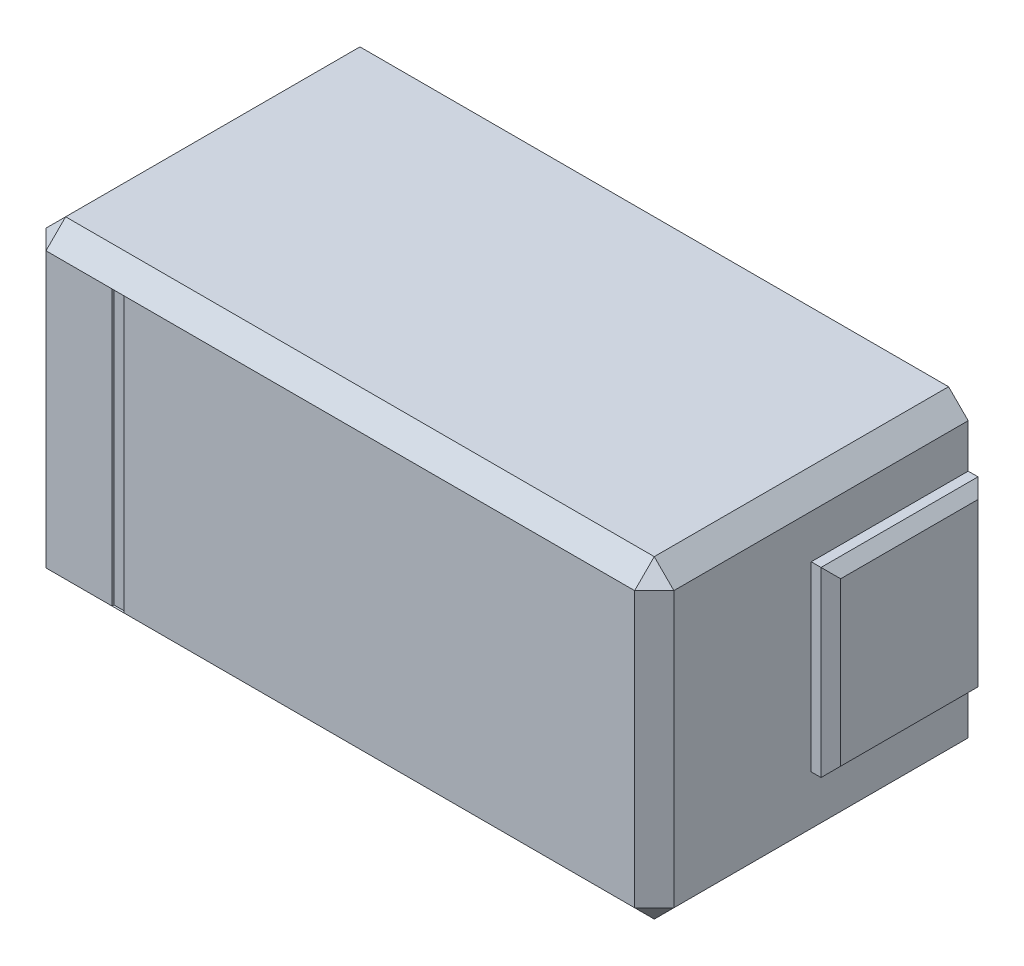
ISO-10303-21;
HEADER;
FILE_DESCRIPTION(('STEP AP214'),'2;1');
FILE_NAME('part.step','',(''),(''),'','','');
FILE_SCHEMA(('AUTOMOTIVE_DESIGN { 1 0 10303 214 1 1 1 1 }'));
ENDSEC;
DATA;
#1=APPLICATION_CONTEXT('core data for automotive mechanical design processes');
#2=APPLICATION_PROTOCOL_DEFINITION('international standard','automotive_design',2000,#1);
#3=PRODUCT_CONTEXT('',#1,'mechanical');
#4=PRODUCT('Part','Part','',(#3));
#5=PRODUCT_RELATED_PRODUCT_CATEGORY('part','',(#4));
#6=PRODUCT_DEFINITION_FORMATION('','',#4);
#7=PRODUCT_DEFINITION_CONTEXT('part definition',#1,'design');
#8=PRODUCT_DEFINITION('design','',#6,#7);
#9=PRODUCT_DEFINITION_SHAPE('','',#8);
#10=(LENGTH_UNIT() NAMED_UNIT(*) SI_UNIT(.MILLI.,.METRE.));
#11=(NAMED_UNIT(*) PLANE_ANGLE_UNIT() SI_UNIT($,.RADIAN.));
#12=(NAMED_UNIT(*) SI_UNIT($,.STERADIAN.) SOLID_ANGLE_UNIT());
#13=UNCERTAINTY_MEASURE_WITH_UNIT(LENGTH_MEASURE(1.E-05),#10,'distance_accuracy_value','');
#14=(GEOMETRIC_REPRESENTATION_CONTEXT(3) GLOBAL_UNCERTAINTY_ASSIGNED_CONTEXT((#13)) GLOBAL_UNIT_ASSIGNED_CONTEXT((#10,
#11,#12)) REPRESENTATION_CONTEXT('',''));
#15=CARTESIAN_POINT('',(0.,0.,0.));
#16=DIRECTION('',(0.,0.,1.));
#17=DIRECTION('',(1.,0.,0.));
#18=AXIS2_PLACEMENT_3D('',#15,#16,#17);
#19=CARTESIAN_POINT('',(0.,0.,1.6));
#20=DIRECTION('',(0.,0.,-1.));
#21=DIRECTION('',(-1.,0.,0.));
#22=AXIS2_PLACEMENT_3D('',#19,#20,#21);
#23=PLANE('',#22);
#24=DIRECTION('',(1.,0.,0.));
#25=VECTOR('',#24,1.);
#26=CARTESIAN_POINT('',(0.,0.0999999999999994,1.6));
#27=LINE('',#26,#25);
#28=CARTESIAN_POINT('',(0.100000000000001,0.0999999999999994,1.6));
#29=VERTEX_POINT('',#28);
#30=CARTESIAN_POINT('',(0.436338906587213,0.100000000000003,1.6));
#31=VERTEX_POINT('',#30);
#32=EDGE_CURVE('E230',#29,#31,#27,.T.);
#33=ORIENTED_EDGE('',*,*,#32,.T.);
#34=DIRECTION('',(0.,-1.,0.));
#35=VECTOR('',#34,1.);
#36=CARTESIAN_POINT('',(0.436338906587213,0.100000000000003,1.6));
#37=LINE('',#36,#35);
#38=CARTESIAN_POINT('',(0.436338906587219,1.50000000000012,1.6));
#39=VERTEX_POINT('',#38);
#40=EDGE_CURVE('E217',#39,#31,#37,.T.);
#41=ORIENTED_EDGE('',*,*,#40,.F.);
#42=DIRECTION('',(-1.,0.,0.));
#43=VECTOR('',#42,1.);
#44=CARTESIAN_POINT('',(0.,1.50000000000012,1.6));
#45=LINE('',#44,#43);
#46=CARTESIAN_POINT('',(0.100000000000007,1.50000000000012,1.6));
#47=VERTEX_POINT('',#46);
#48=EDGE_CURVE('E239',#39,#47,#45,.T.);
#49=ORIENTED_EDGE('',*,*,#48,.T.);
#50=DIRECTION('',(0.,-1.,0.));
#51=VECTOR('',#50,1.);
#52=CARTESIAN_POINT('',(0.100000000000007,0.,1.6));
#53=LINE('',#52,#51);
#54=EDGE_CURVE('E236',#47,#29,#53,.T.);
#55=ORIENTED_EDGE('',*,*,#54,.T.);
#56=EDGE_LOOP('',(#33,#41,#49,#55));
#57=FACE_BOUND('',#56,.T.);
#58=ADVANCED_FACE('F31',(#57),#23,.F.);
#59=CARTESIAN_POINT('',(3.20000000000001,1.60000000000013,1.6));
#60=DIRECTION('',(1.,0.,0.));
#61=DIRECTION('',(0.,0.,-1.));
#62=AXIS2_PLACEMENT_3D('',#59,#60,#61);
#63=PLANE('',#62);
#64=DIRECTION('',(0.,-1.,0.));
#65=VECTOR('',#64,1.);
#66=CARTESIAN_POINT('',(3.2,0.,1.5));
#67=LINE('',#66,#65);
#68=CARTESIAN_POINT('',(3.2,1.50000000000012,1.5));
#69=VERTEX_POINT('',#68);
#70=CARTESIAN_POINT('',(3.2,0.100000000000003,1.5));
#71=VERTEX_POINT('',#70);
#72=EDGE_CURVE('E256',#69,#71,#67,.T.);
#73=ORIENTED_EDGE('',*,*,#72,.T.);
#74=DIRECTION('',(0.,0.,-1.));
#75=VECTOR('',#74,1.);
#76=CARTESIAN_POINT('',(3.2,0.100000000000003,0.));
#77=LINE('',#76,#75);
#78=CARTESIAN_POINT('',(3.2,0.100000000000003,0.));
#79=VERTEX_POINT('',#78);
#80=EDGE_CURVE('E258',#71,#79,#77,.T.);
#81=ORIENTED_EDGE('',*,*,#80,.T.);
#82=DIRECTION('',(0.,-1.,0.));
#83=VECTOR('',#82,1.);
#84=CARTESIAN_POINT('',(3.20000000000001,1.60000000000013,0.));
#85=LINE('',#84,#83);
#86=CARTESIAN_POINT('',(3.2,0.350000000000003,0.));
#87=VERTEX_POINT('',#86);
#88=EDGE_CURVE('E447',#87,#79,#85,.T.);
#89=ORIENTED_EDGE('',*,*,#88,.F.);
#90=DIRECTION('',(0.,0.,-1.));
#91=VECTOR('',#90,1.);
#92=CARTESIAN_POINT('',(3.2,0.350000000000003,0.));
#93=LINE('',#92,#91);
#94=CARTESIAN_POINT('',(3.2,0.350000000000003,0.800000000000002));
#95=VERTEX_POINT('',#94);
#96=EDGE_CURVE('E337',#95,#87,#93,.T.);
#97=ORIENTED_EDGE('',*,*,#96,.F.);
#98=DIRECTION('',(0.,-1.,0.));
#99=VECTOR('',#98,1.);
#100=CARTESIAN_POINT('',(3.2,1.27731712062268,0.800000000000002));
#101=LINE('',#100,#99);
#102=CARTESIAN_POINT('',(3.2,1.27731712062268,0.800000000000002));
#103=VERTEX_POINT('',#102);
#104=EDGE_CURVE('E332',#103,#95,#101,.T.);
#105=ORIENTED_EDGE('',*,*,#104,.F.);
#106=DIRECTION('',(0.,0.,1.));
#107=VECTOR('',#106,1.);
#108=CARTESIAN_POINT('',(3.2,1.27731712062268,0.));
#109=LINE('',#108,#107);
#110=CARTESIAN_POINT('',(3.2,1.27731712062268,0.));
#111=VERTEX_POINT('',#110);
#112=EDGE_CURVE('E441',#111,#103,#109,.T.);
#113=ORIENTED_EDGE('',*,*,#112,.F.);
#114=CARTESIAN_POINT('',(3.2,1.50000000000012,0.));
#115=VERTEX_POINT('',#114);
#116=EDGE_CURVE('E451',#115,#111,#85,.T.);
#117=ORIENTED_EDGE('',*,*,#116,.F.);
#118=DIRECTION('',(0.,0.,1.));
#119=VECTOR('',#118,1.);
#120=CARTESIAN_POINT('',(3.2,1.50000000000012,1.6));
#121=LINE('',#120,#119);
#122=EDGE_CURVE('E254',#115,#69,#121,.T.);
#123=ORIENTED_EDGE('',*,*,#122,.T.);
#124=EDGE_LOOP('',(#73,#81,#89,#97,#105,#113,#117,#123));
#125=FACE_BOUND('',#124,.T.);
#126=ADVANCED_FACE('F448',(#125),#63,.T.);
#127=CARTESIAN_POINT('',(0.,0.,1.6));
#128=DIRECTION('',(-1.,0.,0.));
#129=DIRECTION('',(0.,0.,1.));
#130=AXIS2_PLACEMENT_3D('',#127,#128,#129);
#131=PLANE('',#130);
#132=DIRECTION('',(0.,1.,0.));
#133=VECTOR('',#132,1.);
#134=CARTESIAN_POINT('',(0.,1.60000000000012,1.5));
#135=LINE('',#134,#133);
#136=CARTESIAN_POINT('',(0.,0.100000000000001,1.5));
#137=VERTEX_POINT('',#136);
#138=CARTESIAN_POINT('',(0.,1.50000000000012,1.5));
#139=VERTEX_POINT('',#138);
#140=EDGE_CURVE('E381',#137,#139,#135,.T.);
#141=ORIENTED_EDGE('',*,*,#140,.T.);
#142=DIRECTION('',(0.,0.,-1.));
#143=VECTOR('',#142,1.);
#144=CARTESIAN_POINT('',(0.,1.50000000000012,0.));
#145=LINE('',#144,#143);
#146=CARTESIAN_POINT('',(0.,1.50000000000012,0.));
#147=VERTEX_POINT('',#146);
#148=EDGE_CURVE('E380',#139,#147,#145,.T.);
#149=ORIENTED_EDGE('',*,*,#148,.T.);
#150=DIRECTION('',(0.,1.,0.));
#151=VECTOR('',#150,1.);
#152=CARTESIAN_POINT('',(0.,0.,0.));
#153=LINE('',#152,#151);
#154=CARTESIAN_POINT('',(0.,1.3,0.));
#155=VERTEX_POINT('',#154);
#156=EDGE_CURVE('E272',#155,#147,#153,.T.);
#157=ORIENTED_EDGE('',*,*,#156,.F.);
#158=DIRECTION('',(0.,0.,-1.));
#159=VECTOR('',#158,1.);
#160=CARTESIAN_POINT('',(0.,1.3,0.));
#161=LINE('',#160,#159);
#162=CARTESIAN_POINT('',(0.,1.3,0.750000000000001));
#163=VERTEX_POINT('',#162);
#164=EDGE_CURVE('E296',#163,#155,#161,.T.);
#165=ORIENTED_EDGE('',*,*,#164,.F.);
#166=DIRECTION('',(0.,1.,0.));
#167=VECTOR('',#166,1.);
#168=CARTESIAN_POINT('',(0.,1.3,0.750000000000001));
#169=LINE('',#168,#167);
#170=CARTESIAN_POINT('',(0.,0.3,0.750000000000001));
#171=VERTEX_POINT('',#170);
#172=EDGE_CURVE('E290',#171,#163,#169,.T.);
#173=ORIENTED_EDGE('',*,*,#172,.F.);
#174=DIRECTION('',(0.,0.,1.));
#175=VECTOR('',#174,1.);
#176=CARTESIAN_POINT('',(0.,0.3,0.));
#177=LINE('',#176,#175);
#178=CARTESIAN_POINT('',(0.,0.3,0.));
#179=VERTEX_POINT('',#178);
#180=EDGE_CURVE('E287',#179,#171,#177,.T.);
#181=ORIENTED_EDGE('',*,*,#180,.F.);
#182=CARTESIAN_POINT('',(0.,0.100000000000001,0.));
#183=VERTEX_POINT('',#182);
#184=EDGE_CURVE('E267',#183,#179,#153,.T.);
#185=ORIENTED_EDGE('',*,*,#184,.F.);
#186=DIRECTION('',(0.,0.,1.));
#187=VECTOR('',#186,1.);
#188=CARTESIAN_POINT('',(0.,0.100000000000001,1.6));
#189=LINE('',#188,#187);
#190=EDGE_CURVE('E266',#183,#137,#189,.T.);
#191=ORIENTED_EDGE('',*,*,#190,.T.);
#192=EDGE_LOOP('',(#141,#149,#157,#165,#173,#181,#185,#191));
#193=FACE_BOUND('',#192,.T.);
#194=ADVANCED_FACE('F33',(#193),#131,.T.);
#195=CARTESIAN_POINT('',(0.,0.,1.6));
#196=DIRECTION('',(0.,1.,0.));
#197=DIRECTION('',(0.,0.,1.));
#198=AXIS2_PLACEMENT_3D('',#195,#196,#197);
#199=PLANE('',#198);
#200=DIRECTION('',(-1.,0.,0.));
#201=VECTOR('',#200,1.);
#202=CARTESIAN_POINT('',(0.,0.,1.5));
#203=LINE('',#202,#201);
#204=CARTESIAN_POINT('',(3.1,0.,1.5));
#205=VERTEX_POINT('',#204);
#206=CARTESIAN_POINT('',(0.100000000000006,0.,1.5));
#207=VERTEX_POINT('',#206);
#208=EDGE_CURVE('E262',#205,#207,#203,.T.);
#209=ORIENTED_EDGE('',*,*,#208,.T.);
#210=DIRECTION('',(0.,0.,-1.));
#211=VECTOR('',#210,1.);
#212=CARTESIAN_POINT('',(0.0999999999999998,0.,0.));
#213=LINE('',#212,#211);
#214=CARTESIAN_POINT('',(0.0999999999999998,0.,0.));
#215=VERTEX_POINT('',#214);
#216=EDGE_CURVE('E264',#207,#215,#213,.T.);
#217=ORIENTED_EDGE('',*,*,#216,.T.);
#218=DIRECTION('',(1.,0.,0.));
#219=VECTOR('',#218,1.);
#220=CARTESIAN_POINT('',(0.,0.,0.));
#221=LINE('',#220,#219);
#222=CARTESIAN_POINT('',(3.1,0.,0.));
#223=VERTEX_POINT('',#222);
#224=EDGE_CURVE('E286',#215,#223,#221,.T.);
#225=ORIENTED_EDGE('',*,*,#224,.T.);
#226=DIRECTION('',(0.,0.,1.));
#227=VECTOR('',#226,1.);
#228=CARTESIAN_POINT('',(3.1,0.,1.6));
#229=LINE('',#228,#227);
#230=EDGE_CURVE('E260',#223,#205,#229,.T.);
#231=ORIENTED_EDGE('',*,*,#230,.T.);
#232=EDGE_LOOP('',(#209,#217,#225,#231));
#233=FACE_BOUND('',#232,.T.);
#234=ADVANCED_FACE('F554',(#233),#199,.F.);
#235=CARTESIAN_POINT('',(3.20000000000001,1.60000000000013,1.6));
#236=DIRECTION('',(0.,-1.,0.));
#237=DIRECTION('',(1.,0.,0.));
#238=AXIS2_PLACEMENT_3D('',#235,#236,#237);
#239=PLANE('',#238);
#240=DIRECTION('',(-1.,0.,0.));
#241=VECTOR('',#240,1.);
#242=CARTESIAN_POINT('',(3.20000000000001,1.60000000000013,0.));
#243=LINE('',#242,#241);
#244=CARTESIAN_POINT('',(3.10000000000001,1.60000000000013,0.));
#245=VERTEX_POINT('',#244);
#246=CARTESIAN_POINT('',(0.100000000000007,1.60000000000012,0.));
#247=VERTEX_POINT('',#246);
#248=EDGE_CURVE('E271',#245,#247,#243,.T.);
#249=ORIENTED_EDGE('',*,*,#248,.T.);
#250=DIRECTION('',(0.,0.,1.));
#251=VECTOR('',#250,1.);
#252=CARTESIAN_POINT('',(0.100000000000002,1.60000000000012,1.6));
#253=LINE('',#252,#251);
#254=CARTESIAN_POINT('',(0.100000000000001,1.60000000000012,1.5));
#255=VERTEX_POINT('',#254);
#256=EDGE_CURVE('E252',#247,#255,#253,.T.);
#257=ORIENTED_EDGE('',*,*,#256,.T.);
#258=DIRECTION('',(1.,0.,0.));
#259=VECTOR('',#258,1.);
#260=CARTESIAN_POINT('',(3.20000000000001,1.60000000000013,1.5));
#261=LINE('',#260,#259);
#262=CARTESIAN_POINT('',(3.10000000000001,1.60000000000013,1.5));
#263=VERTEX_POINT('',#262);
#264=EDGE_CURVE('E249',#255,#263,#261,.T.);
#265=ORIENTED_EDGE('',*,*,#264,.T.);
#266=DIRECTION('',(0.,0.,-1.));
#267=VECTOR('',#266,1.);
#268=CARTESIAN_POINT('',(3.10000000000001,1.60000000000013,0.));
#269=LINE('',#268,#267);
#270=EDGE_CURVE('E247',#263,#245,#269,.T.);
#271=ORIENTED_EDGE('',*,*,#270,.T.);
#272=EDGE_LOOP('',(#249,#257,#265,#271));
#273=FACE_BOUND('',#272,.T.);
#274=ADVANCED_FACE('F456',(#273),#239,.F.);
#275=CARTESIAN_POINT('',(3.1,1.50000000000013,1.6));
#276=VERTEX_POINT('',#275);
#277=CARTESIAN_POINT('',(0.498779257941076,1.50000000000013,1.6));
#278=VERTEX_POINT('',#277);
#279=EDGE_CURVE('E244',#276,#278,#45,.T.);
#280=ORIENTED_EDGE('',*,*,#279,.T.);
#281=DIRECTION('',(0.,1.,0.));
#282=VECTOR('',#281,1.);
#283=CARTESIAN_POINT('',(0.49877925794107,0.100000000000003,1.6));
#284=LINE('',#283,#282);
#285=CARTESIAN_POINT('',(0.49877925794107,0.100000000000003,1.6));
#286=VERTEX_POINT('',#285);
#287=EDGE_CURVE('E46',#286,#278,#284,.T.);
#288=ORIENTED_EDGE('',*,*,#287,.F.);
#289=CARTESIAN_POINT('',(3.1,0.100000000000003,1.6));
#290=VERTEX_POINT('',#289);
#291=EDGE_CURVE('E233',#286,#290,#27,.T.);
#292=ORIENTED_EDGE('',*,*,#291,.T.);
#293=DIRECTION('',(0.,1.,0.));
#294=VECTOR('',#293,1.);
#295=CARTESIAN_POINT('',(3.10000000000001,1.60000000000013,1.6));
#296=LINE('',#295,#294);
#297=EDGE_CURVE('E237',#290,#276,#296,.T.);
#298=ORIENTED_EDGE('',*,*,#297,.T.);
#299=EDGE_LOOP('',(#280,#288,#292,#298));
#300=FACE_BOUND('',#299,.T.);
#301=ADVANCED_FACE('F541',(#300),#23,.F.);
#302=CARTESIAN_POINT('',(0.,0.,0.));
#303=DIRECTION('',(0.,0.,-1.));
#304=DIRECTION('',(-1.,0.,0.));
#305=AXIS2_PLACEMENT_3D('',#302,#303,#304);
#306=PLANE('',#305);
#307=DIRECTION('',(1.,0.,0.));
#308=VECTOR('',#307,1.);
#309=CARTESIAN_POINT('',(-0.1,0.3,0.));
#310=LINE('',#309,#308);
#311=CARTESIAN_POINT('',(-0.0499999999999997,0.3,0.));
#312=VERTEX_POINT('',#311);
#313=EDGE_CURVE('E285',#312,#179,#310,.T.);
#314=ORIENTED_EDGE('',*,*,#313,.F.);
#315=DIRECTION('',(0.,1.,0.));
#316=VECTOR('',#315,1.);
#317=CARTESIAN_POINT('',(-0.0499999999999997,0.,0.));
#318=LINE('',#317,#316);
#319=CARTESIAN_POINT('',(-0.0499999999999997,1.3,0.));
#320=VERTEX_POINT('',#319);
#321=EDGE_CURVE('E307',#312,#320,#318,.T.);
#322=ORIENTED_EDGE('',*,*,#321,.T.);
#323=DIRECTION('',(1.,0.,0.));
#324=VECTOR('',#323,1.);
#325=CARTESIAN_POINT('',(-0.1,1.3,0.));
#326=LINE('',#325,#324);
#327=EDGE_CURVE('E345',#320,#155,#326,.T.);
#328=ORIENTED_EDGE('',*,*,#327,.T.);
#329=ORIENTED_EDGE('',*,*,#156,.T.);
#330=DIRECTION('',(0.707106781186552,0.707106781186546,0.));
#331=VECTOR('',#330,1.);
#332=CARTESIAN_POINT('',(-0.750000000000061,0.750000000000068,0.));
#333=LINE('',#332,#331);
#334=EDGE_CURVE('E372',#147,#247,#333,.T.);
#335=ORIENTED_EDGE('',*,*,#334,.T.);
#336=ORIENTED_EDGE('',*,*,#248,.F.);
#337=DIRECTION('',(0.707106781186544,-0.707106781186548,0.));
#338=VECTOR('',#337,1.);
#339=CARTESIAN_POINT('',(2.35000000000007,2.35000000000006,0.));
#340=LINE('',#339,#338);
#341=EDGE_CURVE('E378',#245,#115,#340,.T.);
#342=ORIENTED_EDGE('',*,*,#341,.T.);
#343=ORIENTED_EDGE('',*,*,#116,.T.);
#344=DIRECTION('',(-1.,0.,0.));
#345=VECTOR('',#344,1.);
#346=CARTESIAN_POINT('',(3.3,1.27731712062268,0.));
#347=LINE('',#346,#345);
#348=CARTESIAN_POINT('',(3.25,1.27731712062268,0.));
#349=VERTEX_POINT('',#348);
#350=EDGE_CURVE('E291',#349,#111,#347,.T.);
#351=ORIENTED_EDGE('',*,*,#350,.F.);
#352=DIRECTION('',(0.,-1.,0.));
#353=VECTOR('',#352,1.);
#354=CARTESIAN_POINT('',(3.25,0.350000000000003,0.));
#355=LINE('',#354,#353);
#356=CARTESIAN_POINT('',(3.25,0.350000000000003,0.));
#357=VERTEX_POINT('',#356);
#358=EDGE_CURVE('E305',#349,#357,#355,.T.);
#359=ORIENTED_EDGE('',*,*,#358,.T.);
#360=DIRECTION('',(-1.,0.,0.));
#361=VECTOR('',#360,1.);
#362=CARTESIAN_POINT('',(3.3,0.35,0.));
#363=LINE('',#362,#361);
#364=EDGE_CURVE('E327',#357,#87,#363,.T.);
#365=ORIENTED_EDGE('',*,*,#364,.T.);
#366=ORIENTED_EDGE('',*,*,#88,.T.);
#367=DIRECTION('',(-0.707106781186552,-0.707106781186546,0.));
#368=VECTOR('',#367,1.);
#369=CARTESIAN_POINT('',(1.54999999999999,-1.55000000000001,0.));
#370=LINE('',#369,#368);
#371=EDGE_CURVE('E376',#79,#223,#370,.T.);
#372=ORIENTED_EDGE('',*,*,#371,.T.);
#373=ORIENTED_EDGE('',*,*,#224,.F.);
#374=DIRECTION('',(-0.707106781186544,0.707106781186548,0.));
#375=VECTOR('',#374,1.);
#376=CARTESIAN_POINT('',(0.050000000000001,0.0499999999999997,0.));
#377=LINE('',#376,#375);
#378=EDGE_CURVE('E374',#215,#183,#377,.T.);
#379=ORIENTED_EDGE('',*,*,#378,.T.);
#380=ORIENTED_EDGE('',*,*,#184,.T.);
#381=EDGE_LOOP('',(#314,#322,#328,#329,#335,#336,#342,#343,#351,#359,#365,#366,#372,#373,#379,#380));
#382=FACE_BOUND('',#381,.T.);
#383=ADVANCED_FACE('F462',(#382),#306,.T.);
#384=CARTESIAN_POINT('',(-0.1,0.3,0.));
#385=DIRECTION('',(0.,1.,0.));
#386=DIRECTION('',(0.,0.,1.));
#387=AXIS2_PLACEMENT_3D('',#384,#385,#386);
#388=PLANE('',#387);
#389=DIRECTION('',(1.,0.,0.));
#390=VECTOR('',#389,1.);
#391=CARTESIAN_POINT('',(-0.1,0.3,0.750000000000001));
#392=LINE('',#391,#390);
#393=CARTESIAN_POINT('',(-0.0499999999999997,0.3,0.750000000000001));
#394=VERTEX_POINT('',#393);
#395=EDGE_CURVE('E277',#394,#171,#392,.T.);
#396=ORIENTED_EDGE('',*,*,#395,.F.);
#397=DIRECTION('',(0.,0.,-1.));
#398=VECTOR('',#397,1.);
#399=CARTESIAN_POINT('',(-0.0499999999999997,0.3,0.));
#400=LINE('',#399,#398);
#401=EDGE_CURVE('E303',#394,#312,#400,.T.);
#402=ORIENTED_EDGE('',*,*,#401,.T.);
#403=ORIENTED_EDGE('',*,*,#313,.T.);
#404=ORIENTED_EDGE('',*,*,#180,.T.);
#405=EDGE_LOOP('',(#396,#402,#403,#404));
#406=FACE_BOUND('',#405,.T.);
#407=ADVANCED_FACE('F560',(#406),#388,.F.);
#408=CARTESIAN_POINT('',(-0.1,1.3,0.750000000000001));
#409=DIRECTION('',(0.,0.,-1.));
#410=DIRECTION('',(-1.,0.,0.));
#411=AXIS2_PLACEMENT_3D('',#408,#409,#410);
#412=PLANE('',#411);
#413=DIRECTION('',(1.,0.,0.));
#414=VECTOR('',#413,1.);
#415=CARTESIAN_POINT('',(-0.1,1.3,0.750000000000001));
#416=LINE('',#415,#414);
#417=CARTESIAN_POINT('',(-0.0499999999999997,1.3,0.750000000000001));
#418=VERTEX_POINT('',#417);
#419=EDGE_CURVE('E344',#418,#163,#416,.T.);
#420=ORIENTED_EDGE('',*,*,#419,.F.);
#421=DIRECTION('',(0.,-1.,0.));
#422=VECTOR('',#421,1.);
#423=CARTESIAN_POINT('',(-0.0499999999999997,0.3,0.750000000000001));
#424=LINE('',#423,#422);
#425=EDGE_CURVE('E301',#418,#394,#424,.T.);
#426=ORIENTED_EDGE('',*,*,#425,.T.);
#427=ORIENTED_EDGE('',*,*,#395,.T.);
#428=ORIENTED_EDGE('',*,*,#172,.T.);
#429=EDGE_LOOP('',(#420,#426,#427,#428));
#430=FACE_BOUND('',#429,.T.);
#431=ADVANCED_FACE('F569',(#430),#412,.F.);
#432=CARTESIAN_POINT('',(-0.1,1.3,0.));
#433=DIRECTION('',(0.,-1.,0.));
#434=DIRECTION('',(0.,0.,-1.));
#435=AXIS2_PLACEMENT_3D('',#432,#433,#434);
#436=PLANE('',#435);
#437=ORIENTED_EDGE('',*,*,#327,.F.);
#438=DIRECTION('',(0.,0.,1.));
#439=VECTOR('',#438,1.);
#440=CARTESIAN_POINT('',(-0.0499999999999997,1.3,0.750000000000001));
#441=LINE('',#440,#439);
#442=EDGE_CURVE('E358',#320,#418,#441,.T.);
#443=ORIENTED_EDGE('',*,*,#442,.T.);
#444=ORIENTED_EDGE('',*,*,#419,.T.);
#445=ORIENTED_EDGE('',*,*,#164,.T.);
#446=EDGE_LOOP('',(#437,#443,#444,#445));
#447=FACE_BOUND('',#446,.T.);
#448=ADVANCED_FACE('F464',(#447),#436,.F.);
#449=CARTESIAN_POINT('',(-0.1,0.3,0.));
#450=DIRECTION('',(-1.,0.,0.));
#451=DIRECTION('',(0.,0.,1.));
#452=AXIS2_PLACEMENT_3D('',#449,#450,#451);
#453=PLANE('',#452);
#454=DIRECTION('',(0.,1.,0.));
#455=VECTOR('',#454,1.);
#456=CARTESIAN_POINT('',(-0.1,1.3,0.699999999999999));
#457=LINE('',#456,#455);
#458=CARTESIAN_POINT('',(-0.0999999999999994,0.35,0.699999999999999));
#459=VERTEX_POINT('',#458);
#460=CARTESIAN_POINT('',(-0.0999999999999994,1.25,0.699999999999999));
#461=VERTEX_POINT('',#460);
#462=EDGE_CURVE('E362',#459,#461,#457,.T.);
#463=ORIENTED_EDGE('',*,*,#462,.T.);
#464=DIRECTION('',(0.,0.,-1.));
#465=VECTOR('',#464,1.);
#466=CARTESIAN_POINT('',(-0.0999999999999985,1.25,0.));
#467=LINE('',#466,#465);
#468=CARTESIAN_POINT('',(-0.0999999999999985,1.25,0.0500000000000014));
#469=VERTEX_POINT('',#468);
#470=EDGE_CURVE('E356',#461,#469,#467,.T.);
#471=ORIENTED_EDGE('',*,*,#470,.T.);
#472=DIRECTION('',(0.,-1.,0.));
#473=VECTOR('',#472,1.);
#474=CARTESIAN_POINT('',(-0.1,0.3,0.0500000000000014));
#475=LINE('',#474,#473);
#476=CARTESIAN_POINT('',(-0.0999999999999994,0.35,0.0500000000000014));
#477=VERTEX_POINT('',#476);
#478=EDGE_CURVE('E368',#469,#477,#475,.T.);
#479=ORIENTED_EDGE('',*,*,#478,.T.);
#480=DIRECTION('',(0.,0.,1.));
#481=VECTOR('',#480,1.);
#482=CARTESIAN_POINT('',(-0.0999999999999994,0.35,0.750000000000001));
#483=LINE('',#482,#481);
#484=EDGE_CURVE('E365',#477,#459,#483,.T.);
#485=ORIENTED_EDGE('',*,*,#484,.T.);
#486=EDGE_LOOP('',(#463,#471,#479,#485));
#487=FACE_BOUND('',#486,.T.);
#488=ADVANCED_FACE('F576',(#487),#453,.T.);
#489=CARTESIAN_POINT('',(3.3,1.27731712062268,0.));
#490=DIRECTION('',(0.,-1.,0.));
#491=DIRECTION('',(0.,0.,-1.));
#492=AXIS2_PLACEMENT_3D('',#489,#490,#491);
#493=PLANE('',#492);
#494=DIRECTION('',(-1.,0.,0.));
#495=VECTOR('',#494,1.);
#496=CARTESIAN_POINT('',(3.3,1.27731712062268,0.800000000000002));
#497=LINE('',#496,#495);
#498=CARTESIAN_POINT('',(3.25,1.27731712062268,0.800000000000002));
#499=VERTEX_POINT('',#498);
#500=EDGE_CURVE('E334',#499,#103,#497,.T.);
#501=ORIENTED_EDGE('',*,*,#500,.F.);
#502=DIRECTION('',(0.,0.,-1.));
#503=VECTOR('',#502,1.);
#504=CARTESIAN_POINT('',(3.25,1.27731712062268,0.));
#505=LINE('',#504,#503);
#506=EDGE_CURVE('E11',#499,#349,#505,.T.);
#507=ORIENTED_EDGE('',*,*,#506,.T.);
#508=ORIENTED_EDGE('',*,*,#350,.T.);
#509=ORIENTED_EDGE('',*,*,#112,.T.);
#510=EDGE_LOOP('',(#501,#507,#508,#509));
#511=FACE_BOUND('',#510,.T.);
#512=ADVANCED_FACE('F505',(#511),#493,.F.);
#513=CARTESIAN_POINT('',(3.3,1.27731712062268,0.800000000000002));
#514=DIRECTION('',(0.,0.,-1.));
#515=DIRECTION('',(-1.,0.,0.));
#516=AXIS2_PLACEMENT_3D('',#513,#514,#515);
#517=PLANE('',#516);
#518=DIRECTION('',(-1.,0.,0.));
#519=VECTOR('',#518,1.);
#520=CARTESIAN_POINT('',(3.3,0.35,0.800000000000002));
#521=LINE('',#520,#519);
#522=CARTESIAN_POINT('',(3.25,0.350000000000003,0.800000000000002));
#523=VERTEX_POINT('',#522);
#524=EDGE_CURVE('E325',#523,#95,#521,.T.);
#525=ORIENTED_EDGE('',*,*,#524,.F.);
#526=DIRECTION('',(0.,1.,0.));
#527=VECTOR('',#526,1.);
#528=CARTESIAN_POINT('',(3.25,1.27731712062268,0.800000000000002));
#529=LINE('',#528,#527);
#530=EDGE_CURVE('E39',#523,#499,#529,.T.);
#531=ORIENTED_EDGE('',*,*,#530,.T.);
#532=ORIENTED_EDGE('',*,*,#500,.T.);
#533=ORIENTED_EDGE('',*,*,#104,.T.);
#534=EDGE_LOOP('',(#525,#531,#532,#533));
#535=FACE_BOUND('',#534,.T.);
#536=ADVANCED_FACE('F330',(#535),#517,.F.);
#537=CARTESIAN_POINT('',(3.3,0.35,0.));
#538=DIRECTION('',(0.,1.,0.));
#539=DIRECTION('',(0.,0.,1.));
#540=AXIS2_PLACEMENT_3D('',#537,#538,#539);
#541=PLANE('',#540);
#542=ORIENTED_EDGE('',*,*,#364,.F.);
#543=DIRECTION('',(0.,0.,1.));
#544=VECTOR('',#543,1.);
#545=CARTESIAN_POINT('',(3.25,0.350000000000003,0.));
#546=LINE('',#545,#544);
#547=EDGE_CURVE('E318',#357,#523,#546,.T.);
#548=ORIENTED_EDGE('',*,*,#547,.T.);
#549=ORIENTED_EDGE('',*,*,#524,.T.);
#550=ORIENTED_EDGE('',*,*,#96,.T.);
#551=EDGE_LOOP('',(#542,#548,#549,#550));
#552=FACE_BOUND('',#551,.T.);
#553=ADVANCED_FACE('F323',(#552),#541,.F.);
#554=CARTESIAN_POINT('',(3.3,0.35,0.));
#555=DIRECTION('',(-1.,0.,0.));
#556=DIRECTION('',(0.,0.,1.));
#557=AXIS2_PLACEMENT_3D('',#554,#555,#556);
#558=PLANE('',#557);
#559=DIRECTION('',(0.,-1.,0.));
#560=VECTOR('',#559,1.);
#561=CARTESIAN_POINT('',(3.3,0.35,0.750000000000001));
#562=LINE('',#561,#560);
#563=CARTESIAN_POINT('',(3.30000000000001,1.22731712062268,0.750000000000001));
#564=VERTEX_POINT('',#563);
#565=CARTESIAN_POINT('',(3.30000000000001,0.399999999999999,0.750000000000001));
#566=VERTEX_POINT('',#565);
#567=EDGE_CURVE('E313',#564,#566,#562,.T.);
#568=ORIENTED_EDGE('',*,*,#567,.T.);
#569=DIRECTION('',(0.,0.,-1.));
#570=VECTOR('',#569,1.);
#571=CARTESIAN_POINT('',(3.3,0.399999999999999,0.));
#572=LINE('',#571,#570);
#573=CARTESIAN_POINT('',(3.3,0.399999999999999,0.0500000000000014));
#574=VERTEX_POINT('',#573);
#575=EDGE_CURVE('E315',#566,#574,#572,.T.);
#576=ORIENTED_EDGE('',*,*,#575,.T.);
#577=DIRECTION('',(0.,1.,0.));
#578=VECTOR('',#577,1.);
#579=CARTESIAN_POINT('',(3.3,1.27731712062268,0.0500000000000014));
#580=LINE('',#579,#578);
#581=CARTESIAN_POINT('',(3.3,1.22731712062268,0.0500000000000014));
#582=VERTEX_POINT('',#581);
#583=EDGE_CURVE('E309',#574,#582,#580,.T.);
#584=ORIENTED_EDGE('',*,*,#583,.T.);
#585=DIRECTION('',(0.,0.,1.));
#586=VECTOR('',#585,1.);
#587=CARTESIAN_POINT('',(3.3,1.22731712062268,0.));
#588=LINE('',#587,#586);
#589=EDGE_CURVE('E311',#582,#564,#588,.T.);
#590=ORIENTED_EDGE('',*,*,#589,.T.);
#591=EDGE_LOOP('',(#568,#576,#584,#590));
#592=FACE_BOUND('',#591,.T.);
#593=ADVANCED_FACE('F661',(#592),#558,.F.);
#594=CARTESIAN_POINT('',(3.2,0.100000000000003,1.6));
#595=DIRECTION('',(0.707106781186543,-0.707106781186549,0.));
#596=DIRECTION('',(0.707106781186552,0.707106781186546,0.));
#597=AXIS2_PLACEMENT_3D('',#594,#595,#596);
#598=PLANE('',#597);
#599=ORIENTED_EDGE('',*,*,#371,.F.);
#600=ORIENTED_EDGE('',*,*,#80,.F.);
#601=DIRECTION('',(0.707106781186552,0.707106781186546,0.));
#602=VECTOR('',#601,1.);
#603=CARTESIAN_POINT('',(3.2,0.100000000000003,1.5));
#604=LINE('',#603,#602);
#605=EDGE_CURVE('E438',#205,#71,#604,.T.);
#606=ORIENTED_EDGE('',*,*,#605,.F.);
#607=ORIENTED_EDGE('',*,*,#230,.F.);
#608=EDGE_LOOP('',(#599,#600,#606,#607));
#609=FACE_BOUND('',#608,.T.);
#610=ADVANCED_FACE('F548',(#609),#598,.T.);
#611=CARTESIAN_POINT('',(0.,0.0999999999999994,1.6));
#612=DIRECTION('',(0.,0.70710678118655,-0.707106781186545));
#613=DIRECTION('',(0.,0.707106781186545,0.70710678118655));
#614=AXIS2_PLACEMENT_3D('',#611,#612,#613);
#615=PLANE('',#614);
#616=DIRECTION('',(0.,-0.707106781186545,-0.70710678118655));
#617=VECTOR('',#616,1.);
#618=CARTESIAN_POINT('',(0.100000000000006,0.,1.5));
#619=LINE('',#618,#617);
#620=EDGE_CURVE('E397',#207,#29,#619,.F.);
#621=ORIENTED_EDGE('',*,*,#620,.F.);
#622=ORIENTED_EDGE('',*,*,#208,.F.);
#623=DIRECTION('',(0.,0.707106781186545,0.70710678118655));
#624=VECTOR('',#623,1.);
#625=CARTESIAN_POINT('',(3.10000000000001,0.0500000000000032,1.55));
#626=LINE('',#625,#624);
#627=EDGE_CURVE('E435',#290,#205,#626,.F.);
#628=ORIENTED_EDGE('',*,*,#627,.F.);
#629=ORIENTED_EDGE('',*,*,#291,.F.);
#630=DIRECTION('',(1.,0.,0.));
#631=VECTOR('',#630,1.);
#632=CARTESIAN_POINT('',(0.436338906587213,0.100000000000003,1.6));
#633=LINE('',#632,#631);
#634=EDGE_CURVE('E207',#31,#286,#633,.T.);
#635=ORIENTED_EDGE('',*,*,#634,.F.);
#636=ORIENTED_EDGE('',*,*,#32,.F.);
#637=EDGE_LOOP('',(#621,#622,#628,#629,#635,#636));
#638=FACE_BOUND('',#637,.T.);
#639=ADVANCED_FACE('F229',(#638),#615,.F.);
#640=CARTESIAN_POINT('',(0.100000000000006,0.,1.6));
#641=DIRECTION('',(-0.707106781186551,-0.707106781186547,0.));
#642=DIRECTION('',(0.707106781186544,-0.707106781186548,0.));
#643=AXIS2_PLACEMENT_3D('',#640,#641,#642);
#644=PLANE('',#643);
#645=ORIENTED_EDGE('',*,*,#378,.F.);
#646=ORIENTED_EDGE('',*,*,#216,.F.);
#647=DIRECTION('',(0.707106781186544,-0.707106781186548,0.));
#648=VECTOR('',#647,1.);
#649=CARTESIAN_POINT('',(0.100000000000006,0.,1.5));
#650=LINE('',#649,#648);
#651=EDGE_CURVE('E393',#137,#207,#650,.T.);
#652=ORIENTED_EDGE('',*,*,#651,.F.);
#653=ORIENTED_EDGE('',*,*,#190,.F.);
#654=EDGE_LOOP('',(#645,#646,#652,#653));
#655=FACE_BOUND('',#654,.T.);
#656=ADVANCED_FACE('F395',(#655),#644,.T.);
#657=CARTESIAN_POINT('',(3.2,0.100000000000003,1.5));
#658=DIRECTION('',(0.577350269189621,-0.577350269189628,0.577350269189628));
#659=DIRECTION('',(0.,-0.707106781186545,-0.70710678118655));
#660=AXIS2_PLACEMENT_3D('',#657,#658,#659);
#661=PLANE('',#660);
#662=ORIENTED_EDGE('',*,*,#627,.T.);
#663=ORIENTED_EDGE('',*,*,#605,.T.);
#664=DIRECTION('',(-0.707106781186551,0.,0.707106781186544));
#665=VECTOR('',#664,1.);
#666=CARTESIAN_POINT('',(3.2,0.100000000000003,1.5));
#667=LINE('',#666,#665);
#668=EDGE_CURVE('E398',#290,#71,#667,.F.);
#669=ORIENTED_EDGE('',*,*,#668,.F.);
#670=EDGE_LOOP('',(#662,#663,#669));
#671=FACE_BOUND('',#670,.T.);
#672=ADVANCED_FACE('F551',(#671),#661,.T.);
#673=CARTESIAN_POINT('',(0.100000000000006,0.,1.5));
#674=DIRECTION('',(-0.577350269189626,-0.577350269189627,0.577350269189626));
#675=DIRECTION('',(0.707106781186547,0.,0.707106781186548));
#676=AXIS2_PLACEMENT_3D('',#673,#674,#675);
#677=PLANE('',#676);
#678=ORIENTED_EDGE('',*,*,#651,.T.);
#679=ORIENTED_EDGE('',*,*,#620,.T.);
#680=DIRECTION('',(-0.70710678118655,0.,-0.707106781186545));
#681=VECTOR('',#680,1.);
#682=CARTESIAN_POINT('',(0.0500000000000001,0.100000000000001,1.55));
#683=LINE('',#682,#681);
#684=EDGE_CURVE('E401',#137,#29,#683,.F.);
#685=ORIENTED_EDGE('',*,*,#684,.F.);
#686=EDGE_LOOP('',(#678,#679,#685));
#687=FACE_BOUND('',#686,.T.);
#688=ADVANCED_FACE('F402',(#687),#677,.T.);
#689=CARTESIAN_POINT('',(3.10000000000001,1.60000000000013,1.6));
#690=DIRECTION('',(0.707106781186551,0.707106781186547,0.));
#691=DIRECTION('',(-0.707106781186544,0.707106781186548,0.));
#692=AXIS2_PLACEMENT_3D('',#689,#690,#691);
#693=PLANE('',#692);
#694=ORIENTED_EDGE('',*,*,#341,.F.);
#695=ORIENTED_EDGE('',*,*,#270,.F.);
#696=DIRECTION('',(-0.707106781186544,0.707106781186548,0.));
#697=VECTOR('',#696,1.);
#698=CARTESIAN_POINT('',(3.10000000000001,1.60000000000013,1.5));
#699=LINE('',#698,#697);
#700=EDGE_CURVE('E404',#69,#263,#699,.T.);
#701=ORIENTED_EDGE('',*,*,#700,.F.);
#702=ORIENTED_EDGE('',*,*,#122,.F.);
#703=EDGE_LOOP('',(#694,#695,#701,#702));
#704=FACE_BOUND('',#703,.T.);
#705=ADVANCED_FACE('F499',(#704),#693,.T.);
#706=CARTESIAN_POINT('',(3.20000000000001,1.60000000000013,1.5));
#707=DIRECTION('',(0.707106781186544,0.,0.707106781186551));
#708=DIRECTION('',(0.707106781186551,0.,-0.707106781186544));
#709=AXIS2_PLACEMENT_3D('',#706,#707,#708);
#710=PLANE('',#709);
#711=ORIENTED_EDGE('',*,*,#668,.T.);
#712=ORIENTED_EDGE('',*,*,#72,.F.);
#713=DIRECTION('',(0.707106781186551,0.,-0.707106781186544));
#714=VECTOR('',#713,1.);
#715=CARTESIAN_POINT('',(3.15,1.50000000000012,1.55));
#716=LINE('',#715,#714);
#717=EDGE_CURVE('E413',#276,#69,#716,.T.);
#718=ORIENTED_EDGE('',*,*,#717,.F.);
#719=ORIENTED_EDGE('',*,*,#297,.F.);
#720=EDGE_LOOP('',(#711,#712,#718,#719));
#721=FACE_BOUND('',#720,.T.);
#722=ADVANCED_FACE('F544',(#721),#710,.T.);
#723=CARTESIAN_POINT('',(0.,0.,1.5));
#724=DIRECTION('',(-0.707106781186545,0.,0.70710678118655));
#725=DIRECTION('',(0.70710678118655,0.,0.707106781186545));
#726=AXIS2_PLACEMENT_3D('',#723,#724,#725);
#727=PLANE('',#726);
#728=ORIENTED_EDGE('',*,*,#684,.T.);
#729=ORIENTED_EDGE('',*,*,#54,.F.);
#730=DIRECTION('',(0.70710678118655,0.,0.707106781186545));
#731=VECTOR('',#730,1.);
#732=CARTESIAN_POINT('',(0.100000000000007,1.50000000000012,1.6));
#733=LINE('',#732,#731);
#734=EDGE_CURVE('E409',#139,#47,#733,.T.);
#735=ORIENTED_EDGE('',*,*,#734,.F.);
#736=ORIENTED_EDGE('',*,*,#140,.F.);
#737=EDGE_LOOP('',(#728,#729,#735,#736));
#738=FACE_BOUND('',#737,.T.);
#739=ADVANCED_FACE('F407',(#738),#727,.T.);
#740=CARTESIAN_POINT('',(0.,1.50000000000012,1.6));
#741=DIRECTION('',(-0.707106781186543,0.707106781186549,0.));
#742=DIRECTION('',(-0.707106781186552,-0.707106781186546,0.));
#743=AXIS2_PLACEMENT_3D('',#740,#741,#742);
#744=PLANE('',#743);
#745=ORIENTED_EDGE('',*,*,#334,.F.);
#746=ORIENTED_EDGE('',*,*,#148,.F.);
#747=DIRECTION('',(-0.707106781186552,-0.707106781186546,0.));
#748=VECTOR('',#747,1.);
#749=CARTESIAN_POINT('',(0.0500000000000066,1.55000000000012,1.5));
#750=LINE('',#749,#748);
#751=EDGE_CURVE('E414',#255,#139,#750,.T.);
#752=ORIENTED_EDGE('',*,*,#751,.F.);
#753=ORIENTED_EDGE('',*,*,#256,.F.);
#754=EDGE_LOOP('',(#745,#746,#752,#753));
#755=FACE_BOUND('',#754,.T.);
#756=ADVANCED_FACE('F460',(#755),#744,.T.);
#757=CARTESIAN_POINT('',(3.10000000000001,1.60000000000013,1.5));
#758=DIRECTION('',(0.577350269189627,0.577350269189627,0.577350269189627));
#759=DIRECTION('',(0.707106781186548,0.,-0.707106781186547));
#760=AXIS2_PLACEMENT_3D('',#757,#758,#759);
#761=PLANE('',#760);
#762=ORIENTED_EDGE('',*,*,#717,.T.);
#763=ORIENTED_EDGE('',*,*,#700,.T.);
#764=DIRECTION('',(0.,0.707106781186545,-0.70710678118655));
#765=VECTOR('',#764,1.);
#766=CARTESIAN_POINT('',(3.10000000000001,1.60000000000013,1.5));
#767=LINE('',#766,#765);
#768=EDGE_CURVE('E423',#276,#263,#767,.T.);
#769=ORIENTED_EDGE('',*,*,#768,.F.);
#770=EDGE_LOOP('',(#762,#763,#769));
#771=FACE_BOUND('',#770,.T.);
#772=ADVANCED_FACE('F495',(#771),#761,.T.);
#773=CARTESIAN_POINT('',(0.100000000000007,1.50000000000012,1.6));
#774=DIRECTION('',(-0.57735026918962,0.577350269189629,0.577350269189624));
#775=DIRECTION('',(0.,-0.707106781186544,0.707106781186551));
#776=AXIS2_PLACEMENT_3D('',#773,#774,#775);
#777=PLANE('',#776);
#778=ORIENTED_EDGE('',*,*,#751,.T.);
#779=ORIENTED_EDGE('',*,*,#734,.T.);
#780=DIRECTION('',(0.,-0.707106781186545,0.70710678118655));
#781=VECTOR('',#780,1.);
#782=CARTESIAN_POINT('',(0.100000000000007,1.50000000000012,1.6));
#783=LINE('',#782,#781);
#784=EDGE_CURVE('E419',#255,#47,#783,.T.);
#785=ORIENTED_EDGE('',*,*,#784,.F.);
#786=EDGE_LOOP('',(#778,#779,#785));
#787=FACE_BOUND('',#786,.T.);
#788=ADVANCED_FACE('F417',(#787),#777,.T.);
#789=CARTESIAN_POINT('',(0.,1.50000000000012,1.6));
#790=DIRECTION('',(0.,-0.70710678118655,-0.707106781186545));
#791=DIRECTION('',(0.,0.707106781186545,-0.70710678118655));
#792=AXIS2_PLACEMENT_3D('',#789,#790,#791);
#793=PLANE('',#792);
#794=ORIENTED_EDGE('',*,*,#768,.T.);
#795=ORIENTED_EDGE('',*,*,#264,.F.);
#796=ORIENTED_EDGE('',*,*,#784,.T.);
#797=ORIENTED_EDGE('',*,*,#48,.F.);
#798=DIRECTION('',(-1.,0.,0.));
#799=VECTOR('',#798,1.);
#800=CARTESIAN_POINT('',(0.436338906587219,1.50000000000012,1.6));
#801=LINE('',#800,#799);
#802=EDGE_CURVE('E535',#278,#39,#801,.T.);
#803=ORIENTED_EDGE('',*,*,#802,.F.);
#804=ORIENTED_EDGE('',*,*,#279,.F.);
#805=EDGE_LOOP('',(#794,#795,#796,#797,#803,#804));
#806=FACE_BOUND('',#805,.T.);
#807=ADVANCED_FACE('F489',(#806),#793,.F.);
#808=CARTESIAN_POINT('',(-0.0999999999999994,0.35,0.));
#809=DIRECTION('',(-0.707106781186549,-0.70710678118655,0.));
#810=DIRECTION('',(0.707106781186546,-0.707106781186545,0.));
#811=AXIS2_PLACEMENT_3D('',#808,#809,#810);
#812=PLANE('',#811);
#813=DIRECTION('',(0.577350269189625,-0.577350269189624,-0.577350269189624));
#814=VECTOR('',#813,1.);
#815=CARTESIAN_POINT('',(-0.0833333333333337,0.333333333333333,0.0333333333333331));
#816=LINE('',#815,#814);
#817=EDGE_CURVE('E478',#312,#477,#816,.F.);
#818=ORIENTED_EDGE('',*,*,#817,.F.);
#819=ORIENTED_EDGE('',*,*,#401,.F.);
#820=DIRECTION('',(-0.577350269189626,0.577350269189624,-0.577350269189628));
#821=VECTOR('',#820,1.);
#822=CARTESIAN_POINT('',(-0.333333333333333,0.583333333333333,0.466666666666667));
#823=LINE('',#822,#821);
#824=EDGE_CURVE('E486',#459,#394,#823,.F.);
#825=ORIENTED_EDGE('',*,*,#824,.F.);
#826=ORIENTED_EDGE('',*,*,#484,.F.);
#827=EDGE_LOOP('',(#818,#819,#825,#826));
#828=FACE_BOUND('',#827,.T.);
#829=ADVANCED_FACE('F564',(#828),#812,.T.);
#830=CARTESIAN_POINT('',(-0.1,0.3,0.699999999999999));
#831=DIRECTION('',(-0.707106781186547,0.,0.707106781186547));
#832=DIRECTION('',(0.707106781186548,0.,0.707106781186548));
#833=AXIS2_PLACEMENT_3D('',#830,#831,#832);
#834=PLANE('',#833);
#835=ORIENTED_EDGE('',*,*,#824,.T.);
#836=ORIENTED_EDGE('',*,*,#425,.F.);
#837=DIRECTION('',(-0.577350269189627,-0.577350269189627,-0.577350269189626));
#838=VECTOR('',#837,1.);
#839=CARTESIAN_POINT('',(-0.416666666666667,0.933333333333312,0.383333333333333));
#840=LINE('',#839,#838);
#841=EDGE_CURVE('E470',#461,#418,#840,.F.);
#842=ORIENTED_EDGE('',*,*,#841,.F.);
#843=ORIENTED_EDGE('',*,*,#462,.F.);
#844=EDGE_LOOP('',(#835,#836,#842,#843));
#845=FACE_BOUND('',#844,.T.);
#846=ADVANCED_FACE('F567',(#845),#834,.T.);
#847=CARTESIAN_POINT('',(-0.1,0.3,0.0500000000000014));
#848=DIRECTION('',(0.707106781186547,0.,0.707106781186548));
#849=DIRECTION('',(0.707106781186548,0.,-0.707106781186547));
#850=AXIS2_PLACEMENT_3D('',#847,#848,#849);
#851=PLANE('',#850);
#852=ORIENTED_EDGE('',*,*,#817,.T.);
#853=ORIENTED_EDGE('',*,*,#478,.F.);
#854=DIRECTION('',(-0.577350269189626,-0.577350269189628,0.577350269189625));
#855=VECTOR('',#854,1.);
#856=CARTESIAN_POINT('',(-0.416666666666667,0.93333333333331,0.366666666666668));
#857=LINE('',#856,#855);
#858=EDGE_CURVE('E468',#320,#469,#857,.T.);
#859=ORIENTED_EDGE('',*,*,#858,.F.);
#860=ORIENTED_EDGE('',*,*,#321,.F.);
#861=EDGE_LOOP('',(#852,#853,#859,#860));
#862=FACE_BOUND('',#861,.T.);
#863=ADVANCED_FACE('F475',(#862),#851,.F.);
#864=CARTESIAN_POINT('',(-0.0999999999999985,1.25,0.));
#865=DIRECTION('',(-0.707106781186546,0.707106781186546,0.));
#866=DIRECTION('',(-0.707106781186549,-0.707106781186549,0.));
#867=AXIS2_PLACEMENT_3D('',#864,#865,#866);
#868=PLANE('',#867);
#869=ORIENTED_EDGE('',*,*,#841,.T.);
#870=ORIENTED_EDGE('',*,*,#442,.F.);
#871=ORIENTED_EDGE('',*,*,#858,.T.);
#872=ORIENTED_EDGE('',*,*,#470,.F.);
#873=EDGE_LOOP('',(#869,#870,#871,#872));
#874=FACE_BOUND('',#873,.T.);
#875=ADVANCED_FACE('F467',(#874),#868,.T.);
#876=CARTESIAN_POINT('',(3.3,1.22731712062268,0.));
#877=DIRECTION('',(-0.707106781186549,-0.707106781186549,0.));
#878=DIRECTION('',(0.707106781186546,-0.707106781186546,0.));
#879=AXIS2_PLACEMENT_3D('',#876,#877,#878);
#880=PLANE('',#879);
#881=DIRECTION('',(-0.577350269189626,0.577350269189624,-0.577350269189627));
#882=VECTOR('',#881,1.);
#883=CARTESIAN_POINT('',(3.59243904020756,0.934878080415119,0.342439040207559));
#884=LINE('',#883,#882);
#885=EDGE_CURVE('E481',#349,#582,#884,.F.);
#886=ORIENTED_EDGE('',*,*,#885,.F.);
#887=ORIENTED_EDGE('',*,*,#506,.F.);
#888=DIRECTION('',(0.577350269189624,-0.577350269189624,-0.577350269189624));
#889=VECTOR('',#888,1.);
#890=CARTESIAN_POINT('',(3.55,0.977317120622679,0.5));
#891=LINE('',#890,#889);
#892=EDGE_CURVE('E476',#564,#499,#891,.F.);
#893=ORIENTED_EDGE('',*,*,#892,.F.);
#894=ORIENTED_EDGE('',*,*,#589,.F.);
#895=EDGE_LOOP('',(#886,#887,#893,#894));
#896=FACE_BOUND('',#895,.T.);
#897=ADVANCED_FACE('F512',(#896),#880,.F.);
#898=CARTESIAN_POINT('',(3.3,0.35,0.750000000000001));
#899=DIRECTION('',(-0.707106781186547,0.,-0.707106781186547));
#900=DIRECTION('',(-0.707106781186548,0.,0.707106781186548));
#901=AXIS2_PLACEMENT_3D('',#898,#899,#900);
#902=PLANE('',#901);
#903=ORIENTED_EDGE('',*,*,#892,.T.);
#904=ORIENTED_EDGE('',*,*,#530,.F.);
#905=DIRECTION('',(0.577350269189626,0.577350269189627,-0.577350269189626));
#906=VECTOR('',#905,1.);
#907=CARTESIAN_POINT('',(3.28333333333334,0.383333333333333,0.766666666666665));
#908=LINE('',#907,#906);
#909=EDGE_CURVE('E516',#566,#523,#908,.F.);
#910=ORIENTED_EDGE('',*,*,#909,.F.);
#911=ORIENTED_EDGE('',*,*,#567,.F.);
#912=EDGE_LOOP('',(#903,#904,#910,#911));
#913=FACE_BOUND('',#912,.T.);
#914=ADVANCED_FACE('F808',(#913),#902,.F.);
#915=CARTESIAN_POINT('',(3.3,0.35,0.0500000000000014));
#916=DIRECTION('',(0.707106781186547,0.,-0.707106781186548));
#917=DIRECTION('',(-0.707106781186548,0.,-0.707106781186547));
#918=AXIS2_PLACEMENT_3D('',#915,#916,#917);
#919=PLANE('',#918);
#920=ORIENTED_EDGE('',*,*,#885,.T.);
#921=ORIENTED_EDGE('',*,*,#583,.F.);
#922=DIRECTION('',(0.577350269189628,0.577350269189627,0.577350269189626));
#923=VECTOR('',#922,1.);
#924=CARTESIAN_POINT('',(3.28333333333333,0.383333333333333,0.0333333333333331));
#925=LINE('',#924,#923);
#926=EDGE_CURVE('E518',#357,#574,#925,.T.);
#927=ORIENTED_EDGE('',*,*,#926,.F.);
#928=ORIENTED_EDGE('',*,*,#358,.F.);
#929=EDGE_LOOP('',(#920,#921,#927,#928));
#930=FACE_BOUND('',#929,.T.);
#931=ADVANCED_FACE('F517',(#930),#919,.T.);
#932=CARTESIAN_POINT('',(3.3,0.399999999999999,0.));
#933=DIRECTION('',(-0.707106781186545,0.707106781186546,0.));
#934=DIRECTION('',(-0.70710678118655,-0.707106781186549,0.));
#935=AXIS2_PLACEMENT_3D('',#932,#933,#934);
#936=PLANE('',#935);
#937=ORIENTED_EDGE('',*,*,#909,.T.);
#938=ORIENTED_EDGE('',*,*,#547,.F.);
#939=ORIENTED_EDGE('',*,*,#926,.T.);
#940=ORIENTED_EDGE('',*,*,#575,.F.);
#941=EDGE_LOOP('',(#937,#938,#939,#940));
#942=FACE_BOUND('',#941,.T.);
#943=ADVANCED_FACE('F616',(#942),#936,.F.);
#944=CARTESIAN_POINT('',(0.436338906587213,0.100000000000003,1.59));
#945=DIRECTION('',(-1.,0.,0.));
#946=DIRECTION('',(0.,0.,1.));
#947=AXIS2_PLACEMENT_3D('',#944,#945,#946);
#948=PLANE('',#947);
#949=ORIENTED_EDGE('',*,*,#40,.T.);
#950=DIRECTION('',(0.,0.,1.));
#951=VECTOR('',#950,1.);
#952=CARTESIAN_POINT('',(0.436338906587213,0.100000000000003,1.59));
#953=LINE('',#952,#951);
#954=CARTESIAN_POINT('',(0.436338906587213,0.100000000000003,1.59));
#955=VERTEX_POINT('',#954);
#956=EDGE_CURVE('E203',#955,#31,#953,.T.);
#957=ORIENTED_EDGE('',*,*,#956,.F.);
#958=DIRECTION('',(0.,-1.,0.));
#959=VECTOR('',#958,1.);
#960=CARTESIAN_POINT('',(0.436338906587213,0.100000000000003,1.59));
#961=LINE('',#960,#959);
#962=CARTESIAN_POINT('',(0.436338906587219,1.50000000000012,1.59));
#963=VERTEX_POINT('',#962);
#964=EDGE_CURVE('E533',#963,#955,#961,.T.);
#965=ORIENTED_EDGE('',*,*,#964,.F.);
#966=DIRECTION('',(0.,0.,1.));
#967=VECTOR('',#966,1.);
#968=CARTESIAN_POINT('',(0.436338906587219,1.50000000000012,1.59));
#969=LINE('',#968,#967);
#970=EDGE_CURVE('E219',#963,#39,#969,.T.);
#971=ORIENTED_EDGE('',*,*,#970,.T.);
#972=EDGE_LOOP('',(#949,#957,#965,#971));
#973=FACE_BOUND('',#972,.T.);
#974=ADVANCED_FACE('F218',(#973),#948,.F.);
#975=CARTESIAN_POINT('',(0.436338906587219,1.50000000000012,1.59));
#976=DIRECTION('',(0.,1.,0.));
#977=DIRECTION('',(0.,0.,1.));
#978=AXIS2_PLACEMENT_3D('',#975,#976,#977);
#979=PLANE('',#978);
#980=ORIENTED_EDGE('',*,*,#802,.T.);
#981=ORIENTED_EDGE('',*,*,#970,.F.);
#982=DIRECTION('',(-1.,0.,0.));
#983=VECTOR('',#982,1.);
#984=CARTESIAN_POINT('',(0.436338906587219,1.50000000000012,1.59));
#985=LINE('',#984,#983);
#986=CARTESIAN_POINT('',(0.498779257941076,1.50000000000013,1.59));
#987=VERTEX_POINT('',#986);
#988=EDGE_CURVE('E214',#987,#963,#985,.T.);
#989=ORIENTED_EDGE('',*,*,#988,.F.);
#990=DIRECTION('',(0.,0.,1.));
#991=VECTOR('',#990,1.);
#992=CARTESIAN_POINT('',(0.498779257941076,1.50000000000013,1.59));
#993=LINE('',#992,#991);
#994=EDGE_CURVE('E522',#987,#278,#993,.T.);
#995=ORIENTED_EDGE('',*,*,#994,.T.);
#996=EDGE_LOOP('',(#980,#981,#989,#995));
#997=FACE_BOUND('',#996,.T.);
#998=ADVANCED_FACE('F538',(#997),#979,.F.);
#999=CARTESIAN_POINT('',(0.49877925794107,0.100000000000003,1.59));
#1000=DIRECTION('',(1.,0.,0.));
#1001=DIRECTION('',(0.,0.,-1.));
#1002=AXIS2_PLACEMENT_3D('',#999,#1000,#1001);
#1003=PLANE('',#1002);
#1004=ORIENTED_EDGE('',*,*,#287,.T.);
#1005=ORIENTED_EDGE('',*,*,#994,.F.);
#1006=DIRECTION('',(0.,1.,0.));
#1007=VECTOR('',#1006,1.);
#1008=CARTESIAN_POINT('',(0.49877925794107,0.100000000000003,1.59));
#1009=LINE('',#1008,#1007);
#1010=CARTESIAN_POINT('',(0.49877925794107,0.100000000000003,1.59));
#1011=VERTEX_POINT('',#1010);
#1012=EDGE_CURVE('E529',#1011,#987,#1009,.T.);
#1013=ORIENTED_EDGE('',*,*,#1012,.F.);
#1014=DIRECTION('',(0.,0.,1.));
#1015=VECTOR('',#1014,1.);
#1016=CARTESIAN_POINT('',(0.49877925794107,0.100000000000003,1.59));
#1017=LINE('',#1016,#1015);
#1018=EDGE_CURVE('E213',#1011,#286,#1017,.T.);
#1019=ORIENTED_EDGE('',*,*,#1018,.T.);
#1020=EDGE_LOOP('',(#1004,#1005,#1013,#1019));
#1021=FACE_BOUND('',#1020,.T.);
#1022=ADVANCED_FACE('F633',(#1021),#1003,.F.);
#1023=CARTESIAN_POINT('',(0.436338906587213,0.100000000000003,1.59));
#1024=DIRECTION('',(0.,-1.,0.));
#1025=DIRECTION('',(0.,0.,-1.));
#1026=AXIS2_PLACEMENT_3D('',#1023,#1024,#1025);
#1027=PLANE('',#1026);
#1028=ORIENTED_EDGE('',*,*,#634,.T.);
#1029=ORIENTED_EDGE('',*,*,#1018,.F.);
#1030=DIRECTION('',(1.,0.,0.));
#1031=VECTOR('',#1030,1.);
#1032=CARTESIAN_POINT('',(0.436338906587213,0.100000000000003,1.59));
#1033=LINE('',#1032,#1031);
#1034=EDGE_CURVE('E209',#955,#1011,#1033,.T.);
#1035=ORIENTED_EDGE('',*,*,#1034,.F.);
#1036=ORIENTED_EDGE('',*,*,#956,.T.);
#1037=EDGE_LOOP('',(#1028,#1029,#1035,#1036));
#1038=FACE_BOUND('',#1037,.T.);
#1039=ADVANCED_FACE('F205',(#1038),#1027,.F.);
#1040=CARTESIAN_POINT('',(0.436338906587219,1.50000000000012,1.59));
#1041=DIRECTION('',(0.,0.,-1.));
#1042=DIRECTION('',(-1.,0.,0.));
#1043=AXIS2_PLACEMENT_3D('',#1040,#1041,#1042);
#1044=PLANE('',#1043);
#1045=ORIENTED_EDGE('',*,*,#964,.T.);
#1046=ORIENTED_EDGE('',*,*,#1034,.T.);
#1047=ORIENTED_EDGE('',*,*,#1012,.T.);
#1048=ORIENTED_EDGE('',*,*,#988,.T.);
#1049=EDGE_LOOP('',(#1045,#1046,#1047,#1048));
#1050=FACE_BOUND('',#1049,.T.);
#1051=ADVANCED_FACE('F648',(#1050),#1044,.F.);
#1052=CLOSED_SHELL('',(#58,#126,#194,#234,#274,#301,#383,#407,#431,#448,#488,#512,#536,#553,
#593,#610,#639,#656,#672,#688,#705,#722,#739,#756,#772,#788,#807,#829,#846,#863,#875,#897,#914,
#931,#943,#974,#998,#1022,#1039,#1051));
#1053=MANIFOLD_SOLID_BREP('B2',#1052);
#1054=ADVANCED_BREP_SHAPE_REPRESENTATION('',(#18,#1053),#14);
#1055=SHAPE_DEFINITION_REPRESENTATION(#9,#1054);
ENDSEC;
END-ISO-10303-21;
